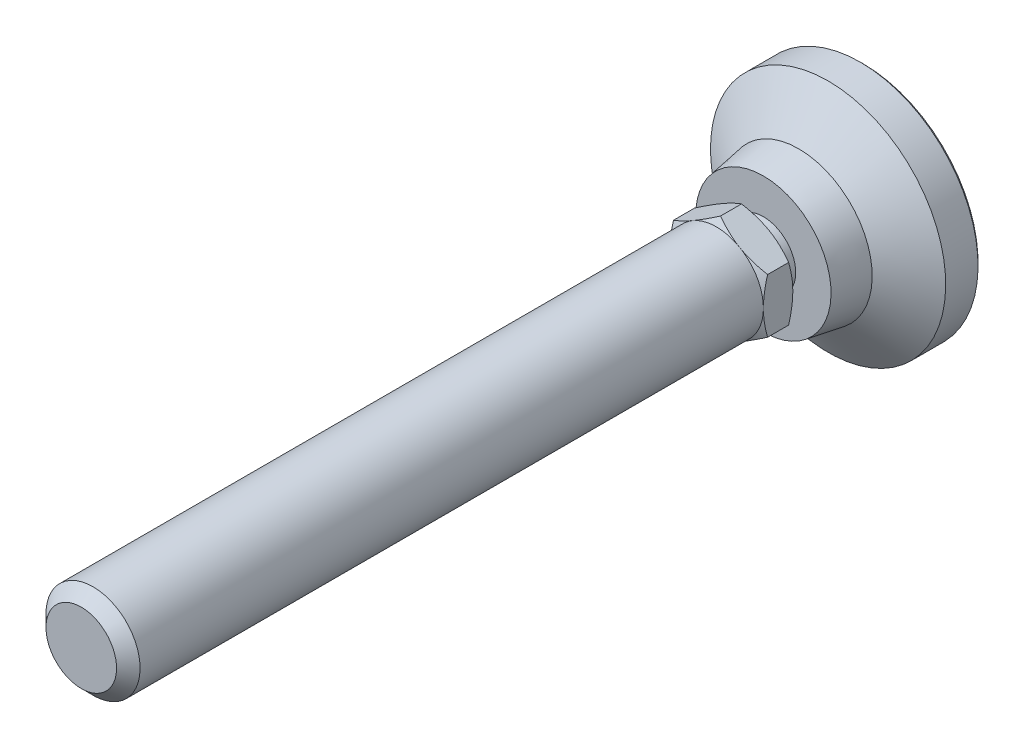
ISO-10303-21;
HEADER;
FILE_DESCRIPTION(('STEP AP214'),'2;1');
FILE_NAME('part.step','',(''),(''),'','','');
FILE_SCHEMA(('AUTOMOTIVE_DESIGN { 1 0 10303 214 1 1 1 1 }'));
ENDSEC;
DATA;
#1=APPLICATION_CONTEXT('core data for automotive mechanical design processes');
#2=APPLICATION_PROTOCOL_DEFINITION('international standard','automotive_design',2000,#1);
#3=PRODUCT_CONTEXT('',#1,'mechanical');
#4=PRODUCT('Part','Part','',(#3));
#5=PRODUCT_RELATED_PRODUCT_CATEGORY('part','',(#4));
#6=PRODUCT_DEFINITION_FORMATION('','',#4);
#7=PRODUCT_DEFINITION_CONTEXT('part definition',#1,'design');
#8=PRODUCT_DEFINITION('design','',#6,#7);
#9=PRODUCT_DEFINITION_SHAPE('','',#8);
#10=(LENGTH_UNIT() NAMED_UNIT(*) SI_UNIT(.MILLI.,.METRE.));
#11=(NAMED_UNIT(*) PLANE_ANGLE_UNIT() SI_UNIT($,.RADIAN.));
#12=(NAMED_UNIT(*) SI_UNIT($,.STERADIAN.) SOLID_ANGLE_UNIT());
#13=UNCERTAINTY_MEASURE_WITH_UNIT(LENGTH_MEASURE(1.E-05),#10,'distance_accuracy_value','');
#14=(GEOMETRIC_REPRESENTATION_CONTEXT(3) GLOBAL_UNCERTAINTY_ASSIGNED_CONTEXT((#13)) GLOBAL_UNIT_ASSIGNED_CONTEXT((#10,
#11,#12)) REPRESENTATION_CONTEXT('',''));
#15=CARTESIAN_POINT('',(0.,0.,0.));
#16=DIRECTION('',(0.,0.,1.));
#17=DIRECTION('',(1.,0.,0.));
#18=AXIS2_PLACEMENT_3D('',#15,#16,#17);
#19=CARTESIAN_POINT('',(0.,-5.50000000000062,19.9999999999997));
#20=DIRECTION('',(0.,0.,-1.));
#21=DIRECTION('',(0.,1.,0.));
#22=AXIS2_PLACEMENT_3D('',#19,#20,#21);
#23=PLANE('',#22);
#24=CARTESIAN_POINT('',(0.,0.,19.9999999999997));
#25=DIRECTION('',(0.,0.,-1.));
#26=DIRECTION('',(0.,1.,0.));
#27=AXIS2_PLACEMENT_3D('',#24,#25,#26);
#28=CIRCLE('',#27,5.50000000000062);
#29=CARTESIAN_POINT('',(0.,5.50000000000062,19.9999999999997));
#30=VERTEX_POINT('',#29);
#31=EDGE_CURVE('E289',#30,#30,#28,.T.);
#32=ORIENTED_EDGE('',*,*,#31,.F.);
#33=EDGE_LOOP('',(#32));
#34=FACE_BOUND('',#33,.T.);
#35=CARTESIAN_POINT('',(0.,0.,19.9999999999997));
#36=DIRECTION('',(0.,0.,-1.));
#37=DIRECTION('',(0.,1.,0.));
#38=AXIS2_PLACEMENT_3D('',#35,#36,#37);
#39=CIRCLE('',#38,8.00000000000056);
#40=CARTESIAN_POINT('',(-4.00000000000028,6.92820323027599,19.9999999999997));
#41=VERTEX_POINT('',#40);
#42=CARTESIAN_POINT('',(4.00000000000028,6.92820323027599,19.9999999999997));
#43=VERTEX_POINT('',#42);
#44=EDGE_CURVE('E18',#41,#43,#39,.T.);
#45=ORIENTED_EDGE('',*,*,#44,.T.);
#46=CARTESIAN_POINT('',(0.,0.,19.9999999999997));
#47=DIRECTION('',(0.,0.,-1.));
#48=DIRECTION('',(0.,1.,0.));
#49=AXIS2_PLACEMENT_3D('',#46,#47,#48);
#50=CIRCLE('',#49,8.00000000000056);
#51=CARTESIAN_POINT('',(8.00000000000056,0.,19.9999999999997));
#52=VERTEX_POINT('',#51);
#53=EDGE_CURVE('E30',#43,#52,#50,.T.);
#54=ORIENTED_EDGE('',*,*,#53,.T.);
#55=CARTESIAN_POINT('',(4.00000000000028,-6.92820323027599,19.9999999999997));
#56=VERTEX_POINT('',#55);
#57=EDGE_CURVE('E9',#52,#56,#39,.T.);
#58=ORIENTED_EDGE('',*,*,#57,.T.);
#59=CARTESIAN_POINT('',(-4.00000000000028,-6.92820323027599,19.9999999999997));
#60=VERTEX_POINT('',#59);
#61=EDGE_CURVE('E23',#56,#60,#39,.T.);
#62=ORIENTED_EDGE('',*,*,#61,.T.);
#63=CARTESIAN_POINT('',(-8.00000000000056,0.,19.9999999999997));
#64=VERTEX_POINT('',#63);
#65=EDGE_CURVE('E270',#60,#64,#39,.T.);
#66=ORIENTED_EDGE('',*,*,#65,.T.);
#67=EDGE_CURVE('E271',#64,#41,#39,.T.);
#68=ORIENTED_EDGE('',*,*,#67,.T.);
#69=EDGE_LOOP('',(#45,#54,#58,#62,#66,#68));
#70=FACE_BOUND('',#69,.T.);
#71=ADVANCED_FACE('F14',(#34,#70),#23,.T.);
#72=CARTESIAN_POINT('',(0.,0.,-1.));
#73=DIRECTION('',(0.,0.,-1.));
#74=DIRECTION('',(0.,1.,0.));
#75=AXIS2_PLACEMENT_3D('',#72,#73,#74);
#76=CYLINDRICAL_SURFACE('',#75,20.);
#77=CARTESIAN_POINT('',(0.,0.,0.500000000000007));
#78=DIRECTION('',(0.,0.,-1.));
#79=DIRECTION('',(0.,1.,0.));
#80=AXIS2_PLACEMENT_3D('',#77,#78,#79);
#81=CIRCLE('',#80,20.);
#82=CARTESIAN_POINT('',(0.,20.,0.500000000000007));
#83=VERTEX_POINT('',#82);
#84=EDGE_CURVE('E309',#83,#83,#81,.F.);
#85=ORIENTED_EDGE('',*,*,#84,.T.);
#86=EDGE_LOOP('',(#85));
#87=FACE_BOUND('',#86,.T.);
#88=CARTESIAN_POINT('',(0.,0.,6.));
#89=DIRECTION('',(0.,0.,-1.));
#90=DIRECTION('',(0.,1.,0.));
#91=AXIS2_PLACEMENT_3D('',#88,#89,#90);
#92=CIRCLE('',#91,20.);
#93=CARTESIAN_POINT('',(0.,20.,6.));
#94=VERTEX_POINT('',#93);
#95=EDGE_CURVE('E290',#94,#94,#92,.T.);
#96=ORIENTED_EDGE('',*,*,#95,.T.);
#97=EDGE_LOOP('',(#96));
#98=FACE_BOUND('',#97,.T.);
#99=ADVANCED_FACE('F332',(#87,#98),#76,.T.);
#100=CARTESIAN_POINT('',(0.,0.,-1.));
#101=DIRECTION('',(0.,0.,-1.));
#102=DIRECTION('',(0.,1.,0.));
#103=AXIS2_PLACEMENT_3D('',#100,#101,#102);
#104=CYLINDRICAL_SURFACE('',#103,5.50000000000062);
#105=CARTESIAN_POINT('',(0.,0.,17.));
#106=DIRECTION('',(0.,0.,-1.));
#107=DIRECTION('',(0.,1.,0.));
#108=AXIS2_PLACEMENT_3D('',#105,#106,#107);
#109=CIRCLE('',#108,5.50000000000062);
#110=CARTESIAN_POINT('',(0.,5.50000000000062,17.));
#111=VERTEX_POINT('',#110);
#112=EDGE_CURVE('E300',#111,#111,#109,.T.);
#113=ORIENTED_EDGE('',*,*,#112,.F.);
#114=EDGE_LOOP('',(#113));
#115=FACE_BOUND('',#114,.T.);
#116=ORIENTED_EDGE('',*,*,#31,.T.);
#117=EDGE_LOOP('',(#116));
#118=FACE_BOUND('',#117,.T.);
#119=ADVANCED_FACE('F338',(#115,#118),#104,.T.);
#120=CARTESIAN_POINT('',(-11.5,0.,17.));
#121=DIRECTION('',(0.,0.,-1.));
#122=DIRECTION('',(0.,1.,0.));
#123=AXIS2_PLACEMENT_3D('',#120,#121,#122);
#124=PLANE('',#123);
#125=CARTESIAN_POINT('',(0.,0.,17.));
#126=DIRECTION('',(0.,0.,-1.));
#127=DIRECTION('',(0.,1.,0.));
#128=AXIS2_PLACEMENT_3D('',#125,#126,#127);
#129=CIRCLE('',#128,11.5);
#130=CARTESIAN_POINT('',(0.,11.5,17.));
#131=VERTEX_POINT('',#130);
#132=EDGE_CURVE('E297',#131,#131,#129,.T.);
#133=ORIENTED_EDGE('',*,*,#132,.F.);
#134=EDGE_LOOP('',(#133));
#135=FACE_BOUND('',#134,.T.);
#136=ORIENTED_EDGE('',*,*,#112,.T.);
#137=EDGE_LOOP('',(#136));
#138=FACE_BOUND('',#137,.T.);
#139=ADVANCED_FACE('F535',(#135,#138),#124,.F.);
#140=CARTESIAN_POINT('',(0.,0.,17.));
#141=DIRECTION('',(0.,0.,-1.));
#142=DIRECTION('',(0.,1.,0.));
#143=AXIS2_PLACEMENT_3D('',#140,#141,#142);
#144=CONICAL_SURFACE('',#143,11.5,0.165148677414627);
#145=CARTESIAN_POINT('',(0.,0.,11.));
#146=DIRECTION('',(0.,0.,-1.));
#147=DIRECTION('',(0.,1.,0.));
#148=AXIS2_PLACEMENT_3D('',#145,#146,#147);
#149=CIRCLE('',#148,12.5);
#150=CARTESIAN_POINT('',(0.,12.5,11.));
#151=VERTEX_POINT('',#150);
#152=EDGE_CURVE('E293',#151,#151,#149,.T.);
#153=ORIENTED_EDGE('',*,*,#152,.F.);
#154=EDGE_LOOP('',(#153));
#155=FACE_BOUND('',#154,.T.);
#156=ORIENTED_EDGE('',*,*,#132,.T.);
#157=EDGE_LOOP('',(#156));
#158=FACE_BOUND('',#157,.T.);
#159=ADVANCED_FACE('F526',(#155,#158),#144,.T.);
#160=CARTESIAN_POINT('',(0.,0.,11.));
#161=DIRECTION('',(0.,0.,-1.));
#162=DIRECTION('',(0.,1.,0.));
#163=AXIS2_PLACEMENT_3D('',#160,#161,#162);
#164=CONICAL_SURFACE('',#163,12.5,0.982793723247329);
#165=ORIENTED_EDGE('',*,*,#95,.F.);
#166=EDGE_LOOP('',(#165));
#167=FACE_BOUND('',#166,.T.);
#168=ORIENTED_EDGE('',*,*,#152,.T.);
#169=EDGE_LOOP('',(#168));
#170=FACE_BOUND('',#169,.T.);
#171=ADVANCED_FACE('F519',(#167,#170),#164,.T.);
#172=CARTESIAN_POINT('',(0.,0.,0.));
#173=DIRECTION('',(0.,0.,-1.));
#174=DIRECTION('',(0.,1.,0.));
#175=AXIS2_PLACEMENT_3D('',#172,#173,#174);
#176=PLANE('',#175);
#177=CARTESIAN_POINT('',(0.,0.,0.));
#178=DIRECTION('',(0.,0.,-1.));
#179=DIRECTION('',(0.,1.,0.));
#180=AXIS2_PLACEMENT_3D('',#177,#178,#179);
#181=CIRCLE('',#180,19.5);
#182=CARTESIAN_POINT('',(0.,19.5,0.));
#183=VERTEX_POINT('',#182);
#184=EDGE_CURVE('E307',#183,#183,#181,.T.);
#185=ORIENTED_EDGE('',*,*,#184,.T.);
#186=EDGE_LOOP('',(#185));
#187=FACE_BOUND('',#186,.T.);
#188=ADVANCED_FACE('F235',(#187),#176,.T.);
#189=CARTESIAN_POINT('',(0.,0.,0.));
#190=DIRECTION('',(0.,0.,1.));
#191=DIRECTION('',(0.,-1.,0.));
#192=AXIS2_PLACEMENT_3D('',#189,#190,#191);
#193=CONICAL_SURFACE('',#192,19.5,0.785398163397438);
#194=ORIENTED_EDGE('',*,*,#84,.F.);
#195=EDGE_LOOP('',(#194));
#196=FACE_BOUND('',#195,.T.);
#197=ORIENTED_EDGE('',*,*,#184,.F.);
#198=EDGE_LOOP('',(#197));
#199=FACE_BOUND('',#198,.T.);
#200=ADVANCED_FACE('F16',(#196,#199),#193,.T.);
#201=CARTESIAN_POINT('',(0.,0.,19.9999999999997));
#202=DIRECTION('',(0.,0.,1.));
#203=DIRECTION('',(0.,-1.,0.));
#204=AXIS2_PLACEMENT_3D('',#201,#202,#203);
#205=CONICAL_SURFACE('',#204,8.00000000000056,1.0471975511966);
#206=ORIENTED_EDGE('',*,*,#44,.F.);
#207=CARTESIAN_POINT('',(0.000200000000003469,9.23771977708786,20.7145978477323));
#208=CARTESIAN_POINT('',(-0.175648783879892,9.13619343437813,20.6559907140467));
#209=CARTESIAN_POINT('',(-0.35215319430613,9.03428856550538,20.6000434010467));
#210=CARTESIAN_POINT('',(-0.706595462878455,8.82965122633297,20.494201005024));
#211=CARTESIAN_POINT('',(-0.884533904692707,8.72691841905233,20.4443085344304));
#212=CARTESIAN_POINT('',(-1.42119823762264,8.41707512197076,20.3046927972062));
#213=CARTESIAN_POINT('',(-1.78204258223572,8.20874154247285,20.2252811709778));
#214=CARTESIAN_POINT('',(-2.32203917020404,7.89697436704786,20.1321616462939));
#215=CARTESIAN_POINT('',(-2.49957818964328,7.79447216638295,20.1056345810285));
#216=CARTESIAN_POINT('',(-2.85545911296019,7.58900421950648,20.0611531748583));
#217=CARTESIAN_POINT('',(-3.03380094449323,7.48603851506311,20.043198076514));
#218=CARTESIAN_POINT('',(-3.39079168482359,7.27992981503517,20.0163156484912));
#219=CARTESIAN_POINT('',(-3.5694400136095,7.17678715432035,20.0073780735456));
#220=CARTESIAN_POINT('',(-3.92690170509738,6.97040655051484,19.9987223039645));
#221=CARTESIAN_POINT('',(-4.10571506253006,6.86716861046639,19.9990038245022));
#222=CARTESIAN_POINT('',(-4.4400133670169,6.67416139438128,20.0081450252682));
#223=CARTESIAN_POINT('',(-4.59552190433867,6.58437849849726,20.0158896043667));
#224=CARTESIAN_POINT('',(-4.90617476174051,6.40502298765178,20.0382011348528));
#225=CARTESIAN_POINT('',(-5.06131905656,6.31545038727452,20.0527685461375));
#226=CARTESIAN_POINT('',(-5.52615131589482,6.04707935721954,20.1063606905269));
#227=CARTESIAN_POINT('',(-5.83501648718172,5.86875596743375,20.1552686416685));
#228=CARTESIAN_POINT('',(-6.4560232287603,5.51021755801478,20.2775394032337));
#229=CARTESIAN_POINT('',(-6.76808554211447,5.33004829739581,20.3514205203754));
#230=CARTESIAN_POINT('',(-7.38755648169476,4.97239658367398,20.5191001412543));
#231=CARTESIAN_POINT('',(-7.69497304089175,4.79490955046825,20.6128592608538));
#232=CARTESIAN_POINT('',(-8.0002,4.61868668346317,20.7145978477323));
#233=B_SPLINE_CURVE_WITH_KNOTS('',3,(#207,#208,#209,#210,#211,#212,#213,#214,#215,#216,#217,
#218,#219,#220,#221,#222,#223,#224,#225,#226,#227,#228,#229,#230,#231,#232),.UNSPECIFIED.,.F.,
.F.,(4,2,2,2,2,2,2,2,2,2,2,2,4),(0.,0.633973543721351,1.26821965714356,2.53934712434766,
3.15934343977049,3.77928496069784,4.39852133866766,5.01773858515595,5.55680239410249,
6.09590254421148,7.17487077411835,8.27776850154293,9.37850115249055),.UNSPECIFIED.);
#234=CARTESIAN_POINT('',(0.,9.23760430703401,20.7145311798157));
#235=VERTEX_POINT('',#234);
#236=EDGE_CURVE('E245',#235,#41,#233,.T.);
#237=ORIENTED_EDGE('',*,*,#236,.F.);
#238=CARTESIAN_POINT('',(8.0002,4.61868668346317,20.7145978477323));
#239=CARTESIAN_POINT('',(7.8243512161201,4.7202130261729,20.6559907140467));
#240=CARTESIAN_POINT('',(7.64784680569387,4.82211789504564,20.6000434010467));
#241=CARTESIAN_POINT('',(7.29340453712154,5.02675523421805,20.494201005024));
#242=CARTESIAN_POINT('',(7.11546609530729,5.1294880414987,20.4443085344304));
#243=CARTESIAN_POINT('',(6.57880176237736,5.43933133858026,20.3046927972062));
#244=CARTESIAN_POINT('',(6.21795741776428,5.64766491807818,20.2252811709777));
#245=CARTESIAN_POINT('',(5.67796082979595,5.95943209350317,20.1321616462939));
#246=CARTESIAN_POINT('',(5.50042181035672,6.06193429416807,20.1056345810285));
#247=CARTESIAN_POINT('',(5.1445408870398,6.26740224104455,20.0611531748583));
#248=CARTESIAN_POINT('',(4.96619905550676,6.37036794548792,20.043198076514));
#249=CARTESIAN_POINT('',(4.60920831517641,6.57647664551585,20.0163156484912));
#250=CARTESIAN_POINT('',(4.4305599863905,6.67961930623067,20.0073780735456));
#251=CARTESIAN_POINT('',(4.07309829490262,6.88599991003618,19.9987223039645));
#252=CARTESIAN_POINT('',(3.89428493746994,6.98923785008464,19.9990038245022));
#253=CARTESIAN_POINT('',(3.5599866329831,7.18224506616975,20.0081450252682));
#254=CARTESIAN_POINT('',(3.40447809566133,7.27202796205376,20.0158896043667));
#255=CARTESIAN_POINT('',(3.09382523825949,7.45138347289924,20.0382011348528));
#256=CARTESIAN_POINT('',(2.93868094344,7.54095607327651,20.0527685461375));
#257=CARTESIAN_POINT('',(2.47384868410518,7.80932710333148,20.1063606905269));
#258=CARTESIAN_POINT('',(2.16498351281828,7.98765049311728,20.1552686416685));
#259=CARTESIAN_POINT('',(1.5439767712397,8.34618890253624,20.2775394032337));
#260=CARTESIAN_POINT('',(1.23191445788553,8.52635816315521,20.3514205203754));
#261=CARTESIAN_POINT('',(0.612443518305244,8.88400987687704,20.5191001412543));
#262=CARTESIAN_POINT('',(0.305026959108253,9.06149691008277,20.6128592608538));
#263=CARTESIAN_POINT('',(-0.000199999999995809,9.23771977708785,20.7145978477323));
#264=B_SPLINE_CURVE_WITH_KNOTS('',3,(#238,#239,#240,#241,#242,#243,#244,#245,#246,#247,#248,
#249,#250,#251,#252,#253,#254,#255,#256,#257,#258,#259,#260,#261,#262,#263),.UNSPECIFIED.,.F.,
.F.,(4,2,2,2,2,2,2,2,2,2,2,2,4),(0.,0.63397354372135,1.26821965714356,2.53934712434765,
3.15934343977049,3.77928496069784,4.39852133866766,5.01773858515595,5.55680239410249,
6.09590254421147,7.17487077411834,8.27776850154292,9.37850115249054),.UNSPECIFIED.);
#265=EDGE_CURVE('E244',#43,#235,#264,.T.);
#266=ORIENTED_EDGE('',*,*,#265,.F.);
#267=EDGE_LOOP('',(#206,#237,#266));
#268=FACE_BOUND('',#267,.T.);
#269=ADVANCED_FACE('F321',(#268),#205,.T.);
#270=CARTESIAN_POINT('',(-8.,4.61880215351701,20.7145311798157));
#271=VERTEX_POINT('',#270);
#272=EDGE_CURVE('E126',#41,#271,#233,.T.);
#273=ORIENTED_EDGE('',*,*,#272,.F.);
#274=ORIENTED_EDGE('',*,*,#67,.F.);
#275=CARTESIAN_POINT('',(-8.,12.3421453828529,23.872930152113));
#276=CARTESIAN_POINT('',(-8.,11.9932734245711,23.7039564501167));
#277=CARTESIAN_POINT('',(-8.,11.6435936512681,23.5366217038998));
#278=CARTESIAN_POINT('',(-8.,10.9421886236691,23.2061532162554));
#279=CARTESIAN_POINT('',(-8.,10.5904630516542,23.0430201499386));
#280=CARTESIAN_POINT('',(-8.,9.88269316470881,22.721043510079));
#281=CARTESIAN_POINT('',(-8.,9.52663571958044,22.5622286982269));
#282=CARTESIAN_POINT('',(-8.,8.81166629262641,22.251184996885));
#283=CARTESIAN_POINT('',(-8.,8.45275444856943,22.0989557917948));
#284=CARTESIAN_POINT('',(-8.,7.72016192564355,21.7981668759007));
#285=CARTESIAN_POINT('',(-8.,7.3463715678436,21.6498728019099));
#286=CARTESIAN_POINT('',(-8.,6.59439485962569,21.3646651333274));
#287=CARTESIAN_POINT('',(-8.,6.21620801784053,21.2277528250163));
#288=CARTESIAN_POINT('',(-8.,5.45556111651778,20.9689508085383));
#289=CARTESIAN_POINT('',(-8.,5.0731117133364,20.8470301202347));
#290=CARTESIAN_POINT('',(-8.,4.3027414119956,20.6221643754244));
#291=CARTESIAN_POINT('',(-8.,3.91482229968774,20.5192132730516));
#292=CARTESIAN_POINT('',(-8.,3.1353733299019,20.337822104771));
#293=CARTESIAN_POINT('',(-8.,2.74387476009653,20.2592512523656));
#294=CARTESIAN_POINT('',(-8.,2.15311394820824,20.1631126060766));
#295=CARTESIAN_POINT('',(-8.,1.95559314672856,20.1346846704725));
#296=CARTESIAN_POINT('',(-8.,1.55959187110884,20.0856270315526));
#297=CARTESIAN_POINT('',(-8.,1.36111149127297,20.0649965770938));
#298=CARTESIAN_POINT('',(-8.,0.966020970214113,20.032200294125));
#299=CARTESIAN_POINT('',(-8.,0.769419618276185,20.0199289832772));
#300=CARTESIAN_POINT('',(-8.,0.375874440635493,20.0037067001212));
#301=CARTESIAN_POINT('',(-8.,0.178930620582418,19.9997555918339));
#302=CARTESIAN_POINT('',(-8.,-0.214948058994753,20.0002678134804));
#303=CARTESIAN_POINT('',(-8.,-0.411882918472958,20.0047311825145));
#304=CARTESIAN_POINT('',(-8.,-0.805391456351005,20.0219643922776));
#305=CARTESIAN_POINT('',(-8.,-1.00196511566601,20.034734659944));
#306=CARTESIAN_POINT('',(-8.,-1.47637711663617,20.0753106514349));
#307=CARTESIAN_POINT('',(-8.,-1.75387603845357,20.1071679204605));
#308=CARTESIAN_POINT('',(-8.,-2.3067584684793,20.185683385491));
#309=CARTESIAN_POINT('',(-8.,-2.58214167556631,20.2323436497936));
#310=CARTESIAN_POINT('',(-8.,-3.4048350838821,20.3920499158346));
#311=CARTESIAN_POINT('',(-8.,-3.94836952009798,20.5247904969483));
#312=CARTESIAN_POINT('',(-8.,-4.76099062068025,20.7542648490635));
#313=CARTESIAN_POINT('',(-8.,-5.03431040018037,20.8368643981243));
#314=CARTESIAN_POINT('',(-8.,-5.57829425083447,21.0104666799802));
#315=CARTESIAN_POINT('',(-8.,-5.84895830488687,21.1014694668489));
#316=CARTESIAN_POINT('',(-8.,-6.38771904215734,21.2904328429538));
#317=CARTESIAN_POINT('',(-8.,-6.65581657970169,21.3883910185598));
#318=CARTESIAN_POINT('',(-8.,-7.18980256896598,21.590130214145));
#319=CARTESIAN_POINT('',(-8.,-7.45569104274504,21.6939111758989));
#320=CARTESIAN_POINT('',(-8.,-8.06696570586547,21.9389857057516));
#321=CARTESIAN_POINT('',(-8.,-8.41165963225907,22.0820023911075));
#322=CARTESIAN_POINT('',(-8.,-9.09824315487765,22.3746341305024));
#323=CARTESIAN_POINT('',(-8.,-9.44013260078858,22.524249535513));
#324=CARTESIAN_POINT('',(-8.,-10.1216015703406,22.8287989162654));
#325=CARTESIAN_POINT('',(-8.,-10.4611806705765,22.983733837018));
#326=CARTESIAN_POINT('',(-8.,-11.138351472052,23.2978949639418));
#327=CARTESIAN_POINT('',(-8.,-11.475943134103,23.4571212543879));
#328=CARTESIAN_POINT('',(-8.,-12.1497762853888,23.7792399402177));
#329=CARTESIAN_POINT('',(-8.,-12.4860161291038,23.9421357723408));
#330=CARTESIAN_POINT('',(-8.,-13.1570717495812,24.270837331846));
#331=CARTESIAN_POINT('',(-8.,-13.4918875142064,24.4366430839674));
#332=CARTESIAN_POINT('',(-8.,-14.4944487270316,24.9376349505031));
#333=CARTESIAN_POINT('',(-8.,-15.1603884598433,25.2764343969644));
#334=CARTESIAN_POINT('',(-8.,-16.4356681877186,25.9335377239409));
#335=CARTESIAN_POINT('',(-8.,-17.0452798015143,26.2513167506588));
#336=CARTESIAN_POINT('',(-8.,-18.2622134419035,26.8912716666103));
#337=CARTESIAN_POINT('',(-8.,-18.8695353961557,27.2134476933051));
#338=CARTESIAN_POINT('',(-8.,-20.0809800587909,27.8604175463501));
#339=CARTESIAN_POINT('',(-8.,-20.6851069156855,28.1852036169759));
#340=CARTESIAN_POINT('',(-8.,-21.8918864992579,28.8374305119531));
#341=CARTESIAN_POINT('',(-8.,-22.4945392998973,29.1648711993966));
#342=CARTESIAN_POINT('',(-8.,-23.0966447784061,29.4933084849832));
#343=B_SPLINE_CURVE_WITH_KNOTS('',3,(#275,#276,#277,#278,#279,#280,#281,#282,#283,#284,#285,
#286,#287,#288,#289,#290,#291,#292,#293,#294,#295,#296,#297,#298,#299,#300,#301,#302,#303,#304,
#305,#306,#307,#308,#309,#310,#311,#312,#313,#314,#315,#316,#317,#318,#319,#320,#321,#322,#323,
#324,#325,#326,#327,#328,#329,#330,#331,#332,#333,#334,#335,#336,#337,#338,#339,#340,#341,#342),
.UNSPECIFIED.,.F.,.F.,(4,2,2,2,2,2,2,2,2,2,2,2,2,2,2,2,2,2,2,2,2,2,2,2,2,2,2,2,2,2,2,2,2,4),(0.,
1.16293058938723,2.32604688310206,3.49560514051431,4.66510728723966,5.87136032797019,
7.07774950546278,8.28160222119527,9.48507058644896,10.6819667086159,11.2805051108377,
11.8789858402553,12.4697671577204,13.0605388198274,13.6513132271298,14.2421179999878,
15.0796080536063,15.9172151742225,17.5933882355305,18.4499038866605,19.3064250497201,
20.162650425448,21.0188672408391,22.1383339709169,23.2578603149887,24.3775865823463,
25.4973348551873,26.618179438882,27.7390335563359,29.9804741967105,32.0428536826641,
34.1052977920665,36.1629829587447,38.2205626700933),.UNSPECIFIED.);
#344=EDGE_CURVE('E38',#271,#64,#343,.T.);
#345=ORIENTED_EDGE('',*,*,#344,.F.);
#346=EDGE_LOOP('',(#273,#274,#345));
#347=FACE_BOUND('',#346,.T.);
#348=ADVANCED_FACE('F155',(#347),#205,.T.);
#349=CARTESIAN_POINT('',(-8.,-4.618802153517,20.7145311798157));
#350=VERTEX_POINT('',#349);
#351=EDGE_CURVE('E246',#64,#350,#343,.T.);
#352=ORIENTED_EDGE('',*,*,#351,.F.);
#353=ORIENTED_EDGE('',*,*,#65,.F.);
#354=CARTESIAN_POINT('',(-8.0002,-4.61868668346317,20.7145978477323));
#355=CARTESIAN_POINT('',(-7.8243512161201,-4.7202130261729,20.6559907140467));
#356=CARTESIAN_POINT('',(-7.64784680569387,-4.82211789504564,20.6000434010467));
#357=CARTESIAN_POINT('',(-7.29340453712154,-5.02675523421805,20.494201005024));
#358=CARTESIAN_POINT('',(-7.11546609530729,-5.12948804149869,20.4443085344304));
#359=CARTESIAN_POINT('',(-6.57880176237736,-5.43933133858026,20.3046927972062));
#360=CARTESIAN_POINT('',(-6.21795741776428,-5.64766491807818,20.2252811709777));
#361=CARTESIAN_POINT('',(-5.67796082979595,-5.95943209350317,20.1321616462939));
#362=CARTESIAN_POINT('',(-5.50042181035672,-6.06193429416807,20.1056345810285));
#363=CARTESIAN_POINT('',(-5.1445408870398,-6.26740224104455,20.0611531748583));
#364=CARTESIAN_POINT('',(-4.96619905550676,-6.37036794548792,20.043198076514));
#365=CARTESIAN_POINT('',(-4.60920831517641,-6.57647664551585,20.0163156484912));
#366=CARTESIAN_POINT('',(-4.4305599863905,-6.67961930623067,20.0073780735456));
#367=CARTESIAN_POINT('',(-4.07309829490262,-6.88599991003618,19.9987223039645));
#368=CARTESIAN_POINT('',(-3.89428493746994,-6.98923785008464,19.9990038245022));
#369=CARTESIAN_POINT('',(-3.5599866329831,-7.18224506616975,20.0081450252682));
#370=CARTESIAN_POINT('',(-3.40447809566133,-7.27202796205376,20.0158896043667));
#371=CARTESIAN_POINT('',(-3.09382523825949,-7.45138347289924,20.0382011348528));
#372=CARTESIAN_POINT('',(-2.93868094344,-7.5409560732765,20.0527685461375));
#373=CARTESIAN_POINT('',(-2.47384868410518,-7.80932710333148,20.1063606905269));
#374=CARTESIAN_POINT('',(-2.16498351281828,-7.98765049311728,20.1552686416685));
#375=CARTESIAN_POINT('',(-1.5439767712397,-8.34618890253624,20.2775394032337));
#376=CARTESIAN_POINT('',(-1.23191445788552,-8.52635816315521,20.3514205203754));
#377=CARTESIAN_POINT('',(-0.612443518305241,-8.88400987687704,20.5191001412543));
#378=CARTESIAN_POINT('',(-0.30502695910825,-9.06149691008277,20.6128592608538));
#379=CARTESIAN_POINT('',(0.000199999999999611,-9.23771977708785,20.7145978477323));
#380=B_SPLINE_CURVE_WITH_KNOTS('',3,(#354,#355,#356,#357,#358,#359,#360,#361,#362,#363,#364,
#365,#366,#367,#368,#369,#370,#371,#372,#373,#374,#375,#376,#377,#378,#379),.UNSPECIFIED.,.F.,
.F.,(4,2,2,2,2,2,2,2,2,2,2,2,4),(0.,0.63397354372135,1.26821965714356,2.53934712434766,
3.15934343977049,3.77928496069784,4.39852133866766,5.01773858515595,5.55680239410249,
6.09590254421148,7.17487077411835,8.27776850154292,9.37850115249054),.UNSPECIFIED.);
#381=EDGE_CURVE('E113',#350,#60,#380,.T.);
#382=ORIENTED_EDGE('',*,*,#381,.F.);
#383=EDGE_LOOP('',(#352,#353,#382));
#384=FACE_BOUND('',#383,.T.);
#385=ADVANCED_FACE('F268',(#384),#205,.T.);
#386=CARTESIAN_POINT('',(0.,-9.23760430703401,20.7145311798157));
#387=VERTEX_POINT('',#386);
#388=EDGE_CURVE('E133',#60,#387,#380,.T.);
#389=ORIENTED_EDGE('',*,*,#388,.F.);
#390=ORIENTED_EDGE('',*,*,#61,.F.);
#391=CARTESIAN_POINT('',(-0.0002,-9.23771977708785,20.7145978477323));
#392=CARTESIAN_POINT('',(0.175648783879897,-9.13619343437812,20.6559907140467));
#393=CARTESIAN_POINT('',(0.352153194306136,-9.03428856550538,20.6000434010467));
#394=CARTESIAN_POINT('',(0.706595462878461,-8.82965122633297,20.494201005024));
#395=CARTESIAN_POINT('',(0.884533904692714,-8.72691841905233,20.4443085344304));
#396=CARTESIAN_POINT('',(1.42119823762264,-8.41707512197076,20.3046927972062));
#397=CARTESIAN_POINT('',(1.78204258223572,-8.20874154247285,20.2252811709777));
#398=CARTESIAN_POINT('',(2.32203917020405,-7.89697436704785,20.1321616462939));
#399=CARTESIAN_POINT('',(2.49957818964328,-7.79447216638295,20.1056345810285));
#400=CARTESIAN_POINT('',(2.8554591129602,-7.58900421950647,20.0611531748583));
#401=CARTESIAN_POINT('',(3.03380094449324,-7.4860385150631,20.043198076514));
#402=CARTESIAN_POINT('',(3.39079168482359,-7.27992981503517,20.0163156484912));
#403=CARTESIAN_POINT('',(3.5694400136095,-7.17678715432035,20.0073780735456));
#404=CARTESIAN_POINT('',(3.92690170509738,-6.97040655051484,19.9987223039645));
#405=CARTESIAN_POINT('',(4.10571506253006,-6.86716861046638,19.9990038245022));
#406=CARTESIAN_POINT('',(4.4400133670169,-6.67416139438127,20.0081450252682));
#407=CARTESIAN_POINT('',(4.59552190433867,-6.58437849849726,20.0158896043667));
#408=CARTESIAN_POINT('',(4.90617476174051,-6.40502298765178,20.0382011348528));
#409=CARTESIAN_POINT('',(5.06131905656,-6.31545038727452,20.0527685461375));
#410=CARTESIAN_POINT('',(5.52615131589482,-6.04707935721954,20.1063606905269));
#411=CARTESIAN_POINT('',(5.83501648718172,-5.86875596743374,20.1552686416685));
#412=CARTESIAN_POINT('',(6.4560232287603,-5.51021755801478,20.2775394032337));
#413=CARTESIAN_POINT('',(6.76808554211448,-5.33004829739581,20.3514205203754));
#414=CARTESIAN_POINT('',(7.38755648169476,-4.97239658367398,20.5191001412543));
#415=CARTESIAN_POINT('',(7.69497304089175,-4.79490955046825,20.6128592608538));
#416=CARTESIAN_POINT('',(8.0002,-4.61868668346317,20.7145978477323));
#417=B_SPLINE_CURVE_WITH_KNOTS('',3,(#391,#392,#393,#394,#395,#396,#397,#398,#399,#400,#401,
#402,#403,#404,#405,#406,#407,#408,#409,#410,#411,#412,#413,#414,#415,#416),.UNSPECIFIED.,.F.,
.F.,(4,2,2,2,2,2,2,2,2,2,2,2,4),(0.,0.63397354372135,1.26821965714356,2.53934712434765,
3.15934343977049,3.77928496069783,4.39852133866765,5.01773858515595,5.55680239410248,
6.09590254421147,7.17487077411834,8.27776850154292,9.37850115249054),.UNSPECIFIED.);
#418=EDGE_CURVE('E274',#387,#56,#417,.T.);
#419=ORIENTED_EDGE('',*,*,#418,.F.);
#420=EDGE_LOOP('',(#389,#390,#419));
#421=FACE_BOUND('',#420,.T.);
#422=ADVANCED_FACE('F273',(#421),#205,.T.);
#423=ORIENTED_EDGE('',*,*,#57,.F.);
#424=CARTESIAN_POINT('',(8.,12.3421453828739,23.8729301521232));
#425=CARTESIAN_POINT('',(8.,11.9932734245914,23.7039564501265));
#426=CARTESIAN_POINT('',(8.,11.6435936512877,23.5366217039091));
#427=CARTESIAN_POINT('',(8.,10.9421886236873,23.2061532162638));
#428=CARTESIAN_POINT('',(8.,10.5904630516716,23.0430201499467));
#429=CARTESIAN_POINT('',(8.,9.88269316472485,22.7210435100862));
#430=CARTESIAN_POINT('',(8.,9.52663571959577,22.5622286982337));
#431=CARTESIAN_POINT('',(8.,8.81166629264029,22.251184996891));
#432=CARTESIAN_POINT('',(8.,8.4527544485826,22.0989557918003));
#433=CARTESIAN_POINT('',(8.,7.72016192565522,21.7981668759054));
#434=CARTESIAN_POINT('',(8.,7.34637156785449,21.6498728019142));
#435=CARTESIAN_POINT('',(8.,6.59439485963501,21.3646651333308));
#436=CARTESIAN_POINT('',(8.,6.21620801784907,21.2277528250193));
#437=CARTESIAN_POINT('',(8.,5.45556111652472,20.9689508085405));
#438=CARTESIAN_POINT('',(8.,5.07311171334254,20.8470301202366));
#439=CARTESIAN_POINT('',(8.,4.30274141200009,20.6221643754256));
#440=CARTESIAN_POINT('',(8.,3.9148222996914,20.5192132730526));
#441=CARTESIAN_POINT('',(8.,3.13537332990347,20.3378221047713));
#442=CARTESIAN_POINT('',(8.,2.74387476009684,20.2592512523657));
#443=CARTESIAN_POINT('',(8.,2.15311394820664,20.1631126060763));
#444=CARTESIAN_POINT('',(8.,1.95559314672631,20.1346846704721));
#445=CARTESIAN_POINT('',(8.,1.5595918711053,20.0856270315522));
#446=CARTESIAN_POINT('',(8.,1.36111149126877,20.0649965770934));
#447=CARTESIAN_POINT('',(8.,0.966020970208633,20.0322002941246));
#448=CARTESIAN_POINT('',(8.,0.769419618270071,20.0199289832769));
#449=CARTESIAN_POINT('',(8.,0.375874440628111,20.003706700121));
#450=CARTESIAN_POINT('',(8.,0.178930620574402,19.9997555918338));
#451=CARTESIAN_POINT('',(8.,-0.21494805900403,20.0002678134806));
#452=CARTESIAN_POINT('',(8.,-0.411882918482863,20.0047311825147));
#453=CARTESIAN_POINT('',(8.,-0.805391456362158,20.0219643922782));
#454=CARTESIAN_POINT('',(8.,-1.00196511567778,20.0347346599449));
#455=CARTESIAN_POINT('',(8.,-1.47637711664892,20.0753106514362));
#456=CARTESIAN_POINT('',(8.,-1.75387603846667,20.1071679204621));
#457=CARTESIAN_POINT('',(8.,-2.30675846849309,20.1856833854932));
#458=CARTESIAN_POINT('',(8.,-2.58214167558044,20.2323436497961));
#459=CARTESIAN_POINT('',(8.,-3.40483508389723,20.392049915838));
#460=CARTESIAN_POINT('',(8.,-3.94836952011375,20.5247904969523));
#461=CARTESIAN_POINT('',(8.,-4.76099062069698,20.7542648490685));
#462=CARTESIAN_POINT('',(8.,-5.03431040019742,20.8368643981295));
#463=CARTESIAN_POINT('',(8.,-5.57829425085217,21.010466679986));
#464=CARTESIAN_POINT('',(8.,-5.8489583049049,21.101469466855));
#465=CARTESIAN_POINT('',(8.,-6.38771904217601,21.2904328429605));
#466=CARTESIAN_POINT('',(8.,-6.65581657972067,21.3883910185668));
#467=CARTESIAN_POINT('',(8.,-7.18980256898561,21.5901302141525));
#468=CARTESIAN_POINT('',(8.,-7.45569104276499,21.6939111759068));
#469=CARTESIAN_POINT('',(8.,-8.06696570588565,21.9389857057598));
#470=CARTESIAN_POINT('',(8.,-8.41165963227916,22.0820023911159));
#471=CARTESIAN_POINT('',(8.,-9.09824315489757,22.374634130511));
#472=CARTESIAN_POINT('',(8.,-9.44013260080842,22.5242495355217));
#473=CARTESIAN_POINT('',(8.,-10.1216015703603,22.8287989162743));
#474=CARTESIAN_POINT('',(8.,-10.4611806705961,22.983733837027));
#475=CARTESIAN_POINT('',(8.,-11.1383514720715,23.2978949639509));
#476=CARTESIAN_POINT('',(8.,-11.4759431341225,23.4571212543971));
#477=CARTESIAN_POINT('',(8.,-12.1497762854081,23.7792399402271));
#478=CARTESIAN_POINT('',(8.,-12.486016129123,23.9421357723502));
#479=CARTESIAN_POINT('',(8.,-13.1570717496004,24.2708373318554));
#480=CARTESIAN_POINT('',(8.,-13.4918875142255,24.4366430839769));
#481=CARTESIAN_POINT('',(8.,-14.4944487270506,24.9376349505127));
#482=CARTESIAN_POINT('',(8.,-15.1603884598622,25.276434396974));
#483=CARTESIAN_POINT('',(8.,-16.4356681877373,25.9335377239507));
#484=CARTESIAN_POINT('',(8.,-17.045279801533,26.2513167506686));
#485=CARTESIAN_POINT('',(8.,-18.2622134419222,26.8912716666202));
#486=CARTESIAN_POINT('',(7.99999999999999,-18.8695353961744,27.213447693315));
#487=CARTESIAN_POINT('',(7.99999999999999,-20.0809800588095,27.8604175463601));
#488=CARTESIAN_POINT('',(7.99999999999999,-20.6851069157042,28.185203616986));
#489=CARTESIAN_POINT('',(7.99999999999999,-21.8918864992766,28.8374305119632));
#490=CARTESIAN_POINT('',(8.,-22.494539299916,29.1648711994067));
#491=CARTESIAN_POINT('',(8.,-23.0966447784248,29.4933084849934));
#492=B_SPLINE_CURVE_WITH_KNOTS('',3,(#424,#425,#426,#427,#428,#429,#430,#431,#432,#433,#434,
#435,#436,#437,#438,#439,#440,#441,#442,#443,#444,#445,#446,#447,#448,#449,#450,#451,#452,#453,
#454,#455,#456,#457,#458,#459,#460,#461,#462,#463,#464,#465,#466,#467,#468,#469,#470,#471,#472,
#473,#474,#475,#476,#477,#478,#479,#480,#481,#482,#483,#484,#485,#486,#487,#488,#489,#490,#491),
.UNSPECIFIED.,.F.,.F.,(4,2,2,2,2,2,2,2,2,2,2,2,2,2,2,2,2,2,2,2,2,2,2,2,2,2,2,2,2,2,2,2,2,4),(0.,
1.16293058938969,2.32604688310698,3.49560514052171,4.66510728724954,5.87136032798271,
7.07774950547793,8.28160222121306,9.48507058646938,10.6819667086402,11.2805051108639,
11.8789858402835,12.4697671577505,13.0605388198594,13.6513132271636,14.2421180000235,
15.0796080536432,15.9172151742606,17.5933882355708,18.449903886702,19.3064250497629,
20.162650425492,21.0188672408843,22.1383339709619,23.2578603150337,24.3775865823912,
25.4973348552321,26.6181794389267,27.7390335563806,29.980474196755,32.0428536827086,
34.105297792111,36.1629829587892,38.2205626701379),.UNSPECIFIED.);
#493=CARTESIAN_POINT('',(8.,-4.61880215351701,20.7145311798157));
#494=VERTEX_POINT('',#493);
#495=EDGE_CURVE('E112',#494,#52,#492,.F.);
#496=ORIENTED_EDGE('',*,*,#495,.F.);
#497=EDGE_CURVE('E118',#56,#494,#417,.T.);
#498=ORIENTED_EDGE('',*,*,#497,.F.);
#499=EDGE_LOOP('',(#423,#496,#498));
#500=FACE_BOUND('',#499,.T.);
#501=ADVANCED_FACE('F116',(#500),#205,.T.);
#502=ORIENTED_EDGE('',*,*,#53,.F.);
#503=CARTESIAN_POINT('',(8.,4.61880215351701,20.7145311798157));
#504=VERTEX_POINT('',#503);
#505=EDGE_CURVE('E107',#504,#43,#264,.T.);
#506=ORIENTED_EDGE('',*,*,#505,.F.);
#507=EDGE_CURVE('E103',#52,#504,#492,.F.);
#508=ORIENTED_EDGE('',*,*,#507,.F.);
#509=EDGE_LOOP('',(#502,#506,#508));
#510=FACE_BOUND('',#509,.T.);
#511=ADVANCED_FACE('F105',(#510),#205,.T.);
#512=CARTESIAN_POINT('',(0.,0.,133.));
#513=DIRECTION('',(0.,0.,-1.));
#514=DIRECTION('',(0.,1.,0.));
#515=AXIS2_PLACEMENT_3D('',#512,#513,#514);
#516=PLANE('',#515);
#517=CARTESIAN_POINT('',(0.,0.,133.));
#518=DIRECTION('',(0.,0.,-1.));
#519=DIRECTION('',(0.,1.,0.));
#520=AXIS2_PLACEMENT_3D('',#517,#518,#519);
#521=CIRCLE('',#520,6.00000000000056);
#522=CARTESIAN_POINT('',(0.,6.00000000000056,133.));
#523=VERTEX_POINT('',#522);
#524=EDGE_CURVE('E353',#523,#523,#521,.T.);
#525=ORIENTED_EDGE('',*,*,#524,.F.);
#526=EDGE_LOOP('',(#525));
#527=FACE_BOUND('',#526,.T.);
#528=ADVANCED_FACE('F341',(#527),#516,.F.);
#529=CARTESIAN_POINT('',(0.,0.,133.));
#530=DIRECTION('',(0.,0.,-1.));
#531=DIRECTION('',(0.,1.,0.));
#532=AXIS2_PLACEMENT_3D('',#529,#530,#531);
#533=CONICAL_SURFACE('',#532,6.00000000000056,0.785398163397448);
#534=CARTESIAN_POINT('',(0.,0.,131.));
#535=DIRECTION('',(0.,0.,-1.));
#536=DIRECTION('',(0.,1.,0.));
#537=AXIS2_PLACEMENT_3D('',#534,#535,#536);
#538=CIRCLE('',#537,8.00000000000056);
#539=CARTESIAN_POINT('',(0.,8.00000000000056,131.));
#540=VERTEX_POINT('',#539);
#541=EDGE_CURVE('E355',#540,#540,#538,.T.);
#542=ORIENTED_EDGE('',*,*,#541,.F.);
#543=EDGE_LOOP('',(#542));
#544=FACE_BOUND('',#543,.T.);
#545=ORIENTED_EDGE('',*,*,#524,.T.);
#546=EDGE_LOOP('',(#545));
#547=FACE_BOUND('',#546,.T.);
#548=ADVANCED_FACE('F197',(#544,#547),#533,.T.);
#549=CARTESIAN_POINT('',(0.,0.,-1.));
#550=DIRECTION('',(0.,0.,-1.));
#551=DIRECTION('',(0.,1.,0.));
#552=AXIS2_PLACEMENT_3D('',#549,#550,#551);
#553=CYLINDRICAL_SURFACE('',#552,8.00000000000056);
#554=CARTESIAN_POINT('',(0.,0.,25.));
#555=DIRECTION('',(0.,0.,-1.));
#556=DIRECTION('',(0.,1.,0.));
#557=AXIS2_PLACEMENT_3D('',#554,#555,#556);
#558=CIRCLE('',#557,8.00000000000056);
#559=CARTESIAN_POINT('',(4.,6.92820323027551,25.));
#560=VERTEX_POINT('',#559);
#561=CARTESIAN_POINT('',(8.,0.,25.));
#562=VERTEX_POINT('',#561);
#563=EDGE_CURVE('E276',#560,#562,#558,.T.);
#564=ORIENTED_EDGE('',*,*,#563,.F.);
#565=CARTESIAN_POINT('',(0.,0.,25.));
#566=DIRECTION('',(0.,0.,-1.));
#567=DIRECTION('',(0.,1.,0.));
#568=AXIS2_PLACEMENT_3D('',#565,#566,#567);
#569=CIRCLE('',#568,8.00000000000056);
#570=CARTESIAN_POINT('',(-4.,6.92820323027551,25.));
#571=VERTEX_POINT('',#570);
#572=EDGE_CURVE('E303',#571,#560,#569,.T.);
#573=ORIENTED_EDGE('',*,*,#572,.F.);
#574=CARTESIAN_POINT('',(-8.,0.,25.));
#575=VERTEX_POINT('',#574);
#576=EDGE_CURVE('E305',#575,#571,#569,.T.);
#577=ORIENTED_EDGE('',*,*,#576,.F.);
#578=CARTESIAN_POINT('',(-4.,-6.92820323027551,25.));
#579=VERTEX_POINT('',#578);
#580=EDGE_CURVE('E370',#579,#575,#569,.T.);
#581=ORIENTED_EDGE('',*,*,#580,.F.);
#582=CARTESIAN_POINT('',(4.,-6.92820323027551,25.));
#583=VERTEX_POINT('',#582);
#584=EDGE_CURVE('E601',#583,#579,#569,.T.);
#585=ORIENTED_EDGE('',*,*,#584,.F.);
#586=EDGE_CURVE('E306',#562,#583,#569,.T.);
#587=ORIENTED_EDGE('',*,*,#586,.F.);
#588=EDGE_LOOP('',(#564,#573,#577,#581,#585,#587));
#589=FACE_BOUND('',#588,.T.);
#590=ORIENTED_EDGE('',*,*,#541,.T.);
#591=EDGE_LOOP('',(#590));
#592=FACE_BOUND('',#591,.T.);
#593=ADVANCED_FACE('F349',(#589,#592),#553,.T.);
#594=CARTESIAN_POINT('',(0.,0.,23.6210154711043));
#595=DIRECTION('',(0.,0.,-1.));
#596=DIRECTION('',(0.,1.,0.));
#597=AXIS2_PLACEMENT_3D('',#594,#595,#596);
#598=CONICAL_SURFACE('',#597,10.3884712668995,1.0471975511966);
#599=ORIENTED_EDGE('',*,*,#563,.T.);
#600=CARTESIAN_POINT('',(8.,12.3421453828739,21.1270698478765));
#601=CARTESIAN_POINT('',(8.,11.9932734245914,21.2960435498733));
#602=CARTESIAN_POINT('',(8.,11.6435936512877,21.4633782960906));
#603=CARTESIAN_POINT('',(8.,10.9421886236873,21.7938467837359));
#604=CARTESIAN_POINT('',(8.,10.5904630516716,21.9569798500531));
#605=CARTESIAN_POINT('',(8.,9.88269316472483,22.2789564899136));
#606=CARTESIAN_POINT('',(8.,9.52663571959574,22.4377713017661));
#607=CARTESIAN_POINT('',(8.,8.81166629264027,22.7488150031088));
#608=CARTESIAN_POINT('',(8.,8.45275444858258,22.9010442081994));
#609=CARTESIAN_POINT('',(8.,7.7201619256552,23.2018331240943));
#610=CARTESIAN_POINT('',(8.,7.34637156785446,23.3501271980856));
#611=CARTESIAN_POINT('',(8.,6.59439485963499,23.6353348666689));
#612=CARTESIAN_POINT('',(8.,6.21620801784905,23.7722471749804));
#613=CARTESIAN_POINT('',(8.,5.45556111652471,24.0310491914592));
#614=CARTESIAN_POINT('',(8.,5.07311171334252,24.1529698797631));
#615=CARTESIAN_POINT('',(8.,4.30274141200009,24.3778356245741));
#616=CARTESIAN_POINT('',(8.,3.9148222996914,24.4807867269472));
#617=CARTESIAN_POINT('',(8.,3.13537332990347,24.6621778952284));
#618=CARTESIAN_POINT('',(8.,2.74387476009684,24.7407487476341));
#619=CARTESIAN_POINT('',(8.,2.15311394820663,24.8368873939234));
#620=CARTESIAN_POINT('',(8.,1.95559314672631,24.8653153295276));
#621=CARTESIAN_POINT('',(8.,1.5595918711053,24.9143729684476));
#622=CARTESIAN_POINT('',(8.,1.36111149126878,24.9350034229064));
#623=CARTESIAN_POINT('',(8.,0.966020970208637,24.9677997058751));
#624=CARTESIAN_POINT('',(8.,0.769419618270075,24.9800710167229));
#625=CARTESIAN_POINT('',(8.,0.375874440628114,24.9962932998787));
#626=CARTESIAN_POINT('',(8.,0.178930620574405,25.0002444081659));
#627=CARTESIAN_POINT('',(8.,-0.214948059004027,24.9997321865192));
#628=CARTESIAN_POINT('',(8.,-0.411882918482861,24.995268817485));
#629=CARTESIAN_POINT('',(8.,-0.805391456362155,24.9780356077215));
#630=CARTESIAN_POINT('',(8.,-1.00196511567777,24.9652653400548));
#631=CARTESIAN_POINT('',(8.,-1.47637711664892,24.9246893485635));
#632=CARTESIAN_POINT('',(8.,-1.75387603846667,24.8928320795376));
#633=CARTESIAN_POINT('',(8.,-2.3067584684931,24.8143166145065));
#634=CARTESIAN_POINT('',(8.,-2.58214167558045,24.7676563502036));
#635=CARTESIAN_POINT('',(8.,-3.40483508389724,24.6079500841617));
#636=CARTESIAN_POINT('',(8.,-3.94836952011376,24.4752095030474));
#637=CARTESIAN_POINT('',(8.,-4.76099062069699,24.2457351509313));
#638=CARTESIAN_POINT('',(8.,-5.03431040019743,24.1631356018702));
#639=CARTESIAN_POINT('',(8.,-5.57829425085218,23.9895333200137));
#640=CARTESIAN_POINT('',(8.,-5.8489583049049,23.8985305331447));
#641=CARTESIAN_POINT('',(8.,-6.38771904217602,23.7095671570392));
#642=CARTESIAN_POINT('',(8.,-6.65581657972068,23.6116089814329));
#643=CARTESIAN_POINT('',(8.,-7.18980256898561,23.4098697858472));
#644=CARTESIAN_POINT('',(8.,-7.45569104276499,23.3060888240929));
#645=CARTESIAN_POINT('',(8.,-8.06696570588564,23.0610142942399));
#646=CARTESIAN_POINT('',(8.,-8.41165963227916,22.9179976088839));
#647=CARTESIAN_POINT('',(8.,-9.09824315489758,22.6253658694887));
#648=CARTESIAN_POINT('',(8.,-9.44013260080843,22.475750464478));
#649=CARTESIAN_POINT('',(8.,-10.1216015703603,22.1712010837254));
#650=CARTESIAN_POINT('',(8.,-10.4611806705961,22.0162661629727));
#651=CARTESIAN_POINT('',(8.,-11.1383514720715,21.7021050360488));
#652=CARTESIAN_POINT('',(8.,-11.4759431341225,21.5428787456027));
#653=CARTESIAN_POINT('',(8.,-12.1497762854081,21.2207600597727));
#654=CARTESIAN_POINT('',(8.,-12.486016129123,21.0578642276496));
#655=CARTESIAN_POINT('',(8.,-13.1570717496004,20.7291626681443));
#656=CARTESIAN_POINT('',(8.,-13.4918875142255,20.5633569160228));
#657=CARTESIAN_POINT('',(8.,-14.4944487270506,20.062365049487));
#658=CARTESIAN_POINT('',(8.,-15.1603884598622,19.7235656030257));
#659=CARTESIAN_POINT('',(8.,-16.4356681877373,19.0664622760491));
#660=CARTESIAN_POINT('',(8.,-17.045279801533,18.7486832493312));
#661=CARTESIAN_POINT('',(8.,-18.2622134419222,18.1087283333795));
#662=CARTESIAN_POINT('',(7.99999999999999,-18.8695353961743,17.7865523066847));
#663=CARTESIAN_POINT('',(7.99999999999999,-20.0809800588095,17.1395824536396));
#664=CARTESIAN_POINT('',(7.99999999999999,-20.6851069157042,16.8147963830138));
#665=CARTESIAN_POINT('',(7.99999999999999,-21.8918864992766,16.1625694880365));
#666=CARTESIAN_POINT('',(8.,-22.494539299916,15.835128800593));
#667=CARTESIAN_POINT('',(8.,-23.0966447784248,15.5066915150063));
#668=B_SPLINE_CURVE_WITH_KNOTS('',3,(#600,#601,#602,#603,#604,#605,#606,#607,#608,#609,#610,
#611,#612,#613,#614,#615,#616,#617,#618,#619,#620,#621,#622,#623,#624,#625,#626,#627,#628,#629,
#630,#631,#632,#633,#634,#635,#636,#637,#638,#639,#640,#641,#642,#643,#644,#645,#646,#647,#648,
#649,#650,#651,#652,#653,#654,#655,#656,#657,#658,#659,#660,#661,#662,#663,#664,#665,#666,#667),
.UNSPECIFIED.,.F.,.F.,(4,2,2,2,2,2,2,2,2,2,2,2,2,2,2,2,2,2,2,2,2,2,2,2,2,2,2,2,2,2,2,2,2,4),(0.,
1.16293058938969,2.32604688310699,3.49560514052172,4.66510728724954,5.87136032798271,
7.07774950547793,8.28160222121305,9.48507058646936,10.6819667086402,11.2805051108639,
11.8789858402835,12.4697671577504,13.0605388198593,13.6513132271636,14.2421180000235,
15.0796080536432,15.9172151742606,17.5933882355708,18.449903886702,19.3064250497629,
20.162650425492,21.0188672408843,22.1383339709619,23.2578603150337,24.3775865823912,
25.4973348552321,26.6181794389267,27.7390335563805,29.9804741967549,32.0428536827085,
34.105297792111,36.1629829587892,38.2205626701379),.UNSPECIFIED.);
#669=CARTESIAN_POINT('',(8.,4.61880215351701,24.285468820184));
#670=VERTEX_POINT('',#669);
#671=EDGE_CURVE('E175',#670,#562,#668,.T.);
#672=ORIENTED_EDGE('',*,*,#671,.F.);
#673=CARTESIAN_POINT('',(-0.000199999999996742,9.23771977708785,24.2854021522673));
#674=CARTESIAN_POINT('',(0.175648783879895,9.13619343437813,24.344009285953));
#675=CARTESIAN_POINT('',(0.352153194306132,9.03428856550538,24.3999565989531));
#676=CARTESIAN_POINT('',(0.706595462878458,8.82965122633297,24.5057989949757));
#677=CARTESIAN_POINT('',(0.884533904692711,8.72691841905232,24.5556914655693));
#678=CARTESIAN_POINT('',(1.42119823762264,8.41707512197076,24.6953072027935));
#679=CARTESIAN_POINT('',(1.78204258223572,8.20874154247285,24.774718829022));
#680=CARTESIAN_POINT('',(2.32203917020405,7.89697436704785,24.8678383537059));
#681=CARTESIAN_POINT('',(2.49957818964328,7.79447216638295,24.8943654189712));
#682=CARTESIAN_POINT('',(2.8554591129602,7.58900421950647,24.9388468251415));
#683=CARTESIAN_POINT('',(3.03380094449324,7.4860385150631,24.9568019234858));
#684=CARTESIAN_POINT('',(3.39079168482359,7.27992981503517,24.9836843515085));
#685=CARTESIAN_POINT('',(3.5694400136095,7.17678715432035,24.9926219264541));
#686=CARTESIAN_POINT('',(3.92690170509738,6.97040655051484,25.0012776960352));
#687=CARTESIAN_POINT('',(4.10571506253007,6.86716861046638,25.0009961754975));
#688=CARTESIAN_POINT('',(4.44001336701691,6.67416139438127,24.9918549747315));
#689=CARTESIAN_POINT('',(4.59552190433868,6.58437849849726,24.984110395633));
#690=CARTESIAN_POINT('',(4.90617476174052,6.40502298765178,24.9617988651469));
#691=CARTESIAN_POINT('',(5.06131905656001,6.31545038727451,24.9472314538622));
#692=CARTESIAN_POINT('',(5.52615131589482,6.04707935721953,24.8936393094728));
#693=CARTESIAN_POINT('',(5.83501648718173,5.86875596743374,24.8447313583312));
#694=CARTESIAN_POINT('',(6.4560232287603,5.51021755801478,24.722460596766));
#695=CARTESIAN_POINT('',(6.76808554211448,5.3300482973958,24.6485794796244));
#696=CARTESIAN_POINT('',(7.38755648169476,4.97239658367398,24.4808998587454));
#697=CARTESIAN_POINT('',(7.69497304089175,4.79490955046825,24.3871407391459));
#698=CARTESIAN_POINT('',(8.0002,4.61868668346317,24.2854021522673));
#699=B_SPLINE_CURVE_WITH_KNOTS('',3,(#673,#674,#675,#676,#677,#678,#679,#680,#681,#682,#683,
#684,#685,#686,#687,#688,#689,#690,#691,#692,#693,#694,#695,#696,#697,#698),.UNSPECIFIED.,.F.,
.F.,(4,2,2,2,2,2,2,2,2,2,2,2,4),(0.,0.633973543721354,1.26821965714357,2.53934712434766,
3.15934343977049,3.77928496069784,4.39852133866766,5.01773858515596,5.5568023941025,
6.09590254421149,7.17487077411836,8.27776850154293,9.37850115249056),.UNSPECIFIED.);
#700=EDGE_CURVE('E183',#560,#670,#699,.T.);
#701=ORIENTED_EDGE('',*,*,#700,.F.);
#702=EDGE_LOOP('',(#599,#672,#701));
#703=FACE_BOUND('',#702,.T.);
#704=ADVANCED_FACE('F379',(#703),#598,.T.);
#705=ORIENTED_EDGE('',*,*,#586,.T.);
#706=CARTESIAN_POINT('',(8.0002,-4.61868668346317,24.2854021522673));
#707=CARTESIAN_POINT('',(7.82435121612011,-4.72021302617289,24.344009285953));
#708=CARTESIAN_POINT('',(7.64784680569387,-4.82211789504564,24.3999565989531));
#709=CARTESIAN_POINT('',(7.29340453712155,-5.02675523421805,24.5057989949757));
#710=CARTESIAN_POINT('',(7.11546609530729,-5.12948804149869,24.5556914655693));
#711=CARTESIAN_POINT('',(6.57880176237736,-5.43933133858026,24.6953072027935));
#712=CARTESIAN_POINT('',(6.21795741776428,-5.64766491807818,24.774718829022));
#713=CARTESIAN_POINT('',(5.67796082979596,-5.95943209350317,24.8678383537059));
#714=CARTESIAN_POINT('',(5.50042181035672,-6.06193429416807,24.8943654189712));
#715=CARTESIAN_POINT('',(5.14454088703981,-6.26740224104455,24.9388468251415));
#716=CARTESIAN_POINT('',(4.96619905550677,-6.37036794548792,24.9568019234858));
#717=CARTESIAN_POINT('',(4.60920831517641,-6.57647664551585,24.9836843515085));
#718=CARTESIAN_POINT('',(4.4305599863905,-6.67961930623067,24.9926219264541));
#719=CARTESIAN_POINT('',(4.07309829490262,-6.88599991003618,25.0012776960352));
#720=CARTESIAN_POINT('',(3.89428493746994,-6.98923785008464,25.0009961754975));
#721=CARTESIAN_POINT('',(3.5599866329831,-7.18224506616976,24.9918549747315));
#722=CARTESIAN_POINT('',(3.40447809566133,-7.27202796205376,24.984110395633));
#723=CARTESIAN_POINT('',(3.09382523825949,-7.45138347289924,24.9617988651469));
#724=CARTESIAN_POINT('',(2.93868094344,-7.54095607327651,24.9472314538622));
#725=CARTESIAN_POINT('',(2.47384868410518,-7.80932710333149,24.8936393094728));
#726=CARTESIAN_POINT('',(2.16498351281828,-7.98765049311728,24.8447313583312));
#727=CARTESIAN_POINT('',(1.5439767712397,-8.34618890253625,24.722460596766));
#728=CARTESIAN_POINT('',(1.23191445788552,-8.52635816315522,24.6485794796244));
#729=CARTESIAN_POINT('',(0.612443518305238,-8.88400987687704,24.4808998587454));
#730=CARTESIAN_POINT('',(0.305026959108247,-9.06149691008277,24.3871407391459));
#731=CARTESIAN_POINT('',(-0.000199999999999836,-9.23771977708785,24.2854021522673));
#732=B_SPLINE_CURVE_WITH_KNOTS('',3,(#706,#707,#708,#709,#710,#711,#712,#713,#714,#715,#716,
#717,#718,#719,#720,#721,#722,#723,#724,#725,#726,#727,#728,#729,#730,#731),.UNSPECIFIED.,.F.,
.F.,(4,2,2,2,2,2,2,2,2,2,2,2,4),(0.,0.633973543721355,1.26821965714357,2.53934712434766,
3.15934343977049,3.77928496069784,4.39852133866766,5.01773858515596,5.5568023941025,
6.09590254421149,7.17487077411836,8.27776850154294,9.37850115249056),.UNSPECIFIED.);
#733=CARTESIAN_POINT('',(8.,-4.61880215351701,24.285468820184));
#734=VERTEX_POINT('',#733);
#735=EDGE_CURVE('E176',#734,#583,#732,.T.);
#736=ORIENTED_EDGE('',*,*,#735,.F.);
#737=EDGE_CURVE('E168',#562,#734,#668,.T.);
#738=ORIENTED_EDGE('',*,*,#737,.F.);
#739=EDGE_LOOP('',(#705,#736,#738));
#740=FACE_BOUND('',#739,.T.);
#741=ADVANCED_FACE('F443',(#740),#598,.T.);
#742=ORIENTED_EDGE('',*,*,#584,.T.);
#743=CARTESIAN_POINT('',(0.00020000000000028,-9.23771977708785,24.2854021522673));
#744=CARTESIAN_POINT('',(-0.175648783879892,-9.13619343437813,24.344009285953));
#745=CARTESIAN_POINT('',(-0.352153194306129,-9.03428856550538,24.3999565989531));
#746=CARTESIAN_POINT('',(-0.706595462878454,-8.82965122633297,24.5057989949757));
#747=CARTESIAN_POINT('',(-0.884533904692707,-8.72691841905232,24.5556914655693));
#748=CARTESIAN_POINT('',(-1.42119823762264,-8.41707512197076,24.6953072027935));
#749=CARTESIAN_POINT('',(-1.78204258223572,-8.20874154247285,24.774718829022));
#750=CARTESIAN_POINT('',(-2.32203917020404,-7.89697436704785,24.8678383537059));
#751=CARTESIAN_POINT('',(-2.49957818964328,-7.79447216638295,24.8943654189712));
#752=CARTESIAN_POINT('',(-2.85545911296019,-7.58900421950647,24.9388468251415));
#753=CARTESIAN_POINT('',(-3.03380094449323,-7.4860385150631,24.9568019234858));
#754=CARTESIAN_POINT('',(-3.39079168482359,-7.27992981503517,24.9836843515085));
#755=CARTESIAN_POINT('',(-3.5694400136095,-7.17678715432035,24.9926219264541));
#756=CARTESIAN_POINT('',(-3.92690170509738,-6.97040655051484,25.0012776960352));
#757=CARTESIAN_POINT('',(-4.10571506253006,-6.86716861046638,25.0009961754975));
#758=CARTESIAN_POINT('',(-4.4400133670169,-6.67416139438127,24.9918549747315));
#759=CARTESIAN_POINT('',(-4.59552190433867,-6.58437849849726,24.984110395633));
#760=CARTESIAN_POINT('',(-4.90617476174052,-6.40502298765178,24.9617988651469));
#761=CARTESIAN_POINT('',(-5.06131905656,-6.31545038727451,24.9472314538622));
#762=CARTESIAN_POINT('',(-5.52615131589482,-6.04707935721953,24.8936393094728));
#763=CARTESIAN_POINT('',(-5.83501648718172,-5.86875596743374,24.8447313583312));
#764=CARTESIAN_POINT('',(-6.4560232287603,-5.51021755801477,24.722460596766));
#765=CARTESIAN_POINT('',(-6.76808554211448,-5.3300482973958,24.6485794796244));
#766=CARTESIAN_POINT('',(-7.38755648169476,-4.97239658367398,24.4808998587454));
#767=CARTESIAN_POINT('',(-7.69497304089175,-4.79490955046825,24.3871407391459));
#768=CARTESIAN_POINT('',(-8.0002,-4.61868668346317,24.2854021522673));
#769=B_SPLINE_CURVE_WITH_KNOTS('',3,(#743,#744,#745,#746,#747,#748,#749,#750,#751,#752,#753,
#754,#755,#756,#757,#758,#759,#760,#761,#762,#763,#764,#765,#766,#767,#768),.UNSPECIFIED.,.F.,
.F.,(4,2,2,2,2,2,2,2,2,2,2,2,4),(0.,0.633973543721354,1.26821965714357,2.53934712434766,
3.15934343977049,3.77928496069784,4.39852133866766,5.01773858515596,5.5568023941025,
6.09590254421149,7.17487077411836,8.27776850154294,9.37850115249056),.UNSPECIFIED.);
#770=CARTESIAN_POINT('',(0.,-9.23760430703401,24.285468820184));
#771=VERTEX_POINT('',#770);
#772=EDGE_CURVE('E223',#771,#579,#769,.T.);
#773=ORIENTED_EDGE('',*,*,#772,.F.);
#774=EDGE_CURVE('E177',#583,#771,#732,.T.);
#775=ORIENTED_EDGE('',*,*,#774,.F.);
#776=EDGE_LOOP('',(#742,#773,#775));
#777=FACE_BOUND('',#776,.T.);
#778=ADVANCED_FACE('F435',(#777),#598,.T.);
#779=ORIENTED_EDGE('',*,*,#580,.T.);
#780=CARTESIAN_POINT('',(-8.,12.3421453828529,21.1270698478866));
#781=CARTESIAN_POINT('',(-8.,11.9932734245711,21.296043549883));
#782=CARTESIAN_POINT('',(-8.,11.6435936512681,21.4633782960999));
#783=CARTESIAN_POINT('',(-8.,10.9421886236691,21.7938467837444));
#784=CARTESIAN_POINT('',(-8.,10.5904630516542,21.9569798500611));
#785=CARTESIAN_POINT('',(-8.,9.88269316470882,22.2789564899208));
#786=CARTESIAN_POINT('',(-8.,9.52663571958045,22.4377713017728));
#787=CARTESIAN_POINT('',(-8.,8.81166629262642,22.7488150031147));
#788=CARTESIAN_POINT('',(-8.,8.45275444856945,22.9010442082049));
#789=CARTESIAN_POINT('',(-8.,7.72016192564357,23.201833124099));
#790=CARTESIAN_POINT('',(-8.,7.34637156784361,23.3501271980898));
#791=CARTESIAN_POINT('',(-8.,6.5943948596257,23.6353348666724));
#792=CARTESIAN_POINT('',(-8.,6.21620801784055,23.7722471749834));
#793=CARTESIAN_POINT('',(-8.,5.4555611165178,24.0310491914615));
#794=CARTESIAN_POINT('',(-8.,5.07311171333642,24.152969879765));
#795=CARTESIAN_POINT('',(-8.,4.30274141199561,24.3778356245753));
#796=CARTESIAN_POINT('',(-8.,3.91482229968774,24.4807867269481));
#797=CARTESIAN_POINT('',(-8.,3.1353733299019,24.6621778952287));
#798=CARTESIAN_POINT('',(-8.,2.74387476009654,24.7407487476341));
#799=CARTESIAN_POINT('',(-8.,2.15311394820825,24.8368873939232));
#800=CARTESIAN_POINT('',(-8.,1.95559314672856,24.8653153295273));
#801=CARTESIAN_POINT('',(-8.,1.55959187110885,24.9143729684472));
#802=CARTESIAN_POINT('',(-8.,1.36111149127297,24.9350034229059));
#803=CARTESIAN_POINT('',(-8.,0.966020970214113,24.9677997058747));
#804=CARTESIAN_POINT('',(-8.,0.769419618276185,24.9800710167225));
#805=CARTESIAN_POINT('',(-8.,0.375874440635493,24.9962932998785));
#806=CARTESIAN_POINT('',(-8.,0.178930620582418,25.0002444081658));
#807=CARTESIAN_POINT('',(-8.,-0.214948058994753,24.9997321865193));
#808=CARTESIAN_POINT('',(-8.,-0.411882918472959,24.9952688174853));
#809=CARTESIAN_POINT('',(-8.,-0.805391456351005,24.9780356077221));
#810=CARTESIAN_POINT('',(-8.,-1.001965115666,24.9652653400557));
#811=CARTESIAN_POINT('',(-8.,-1.47637711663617,24.9246893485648));
#812=CARTESIAN_POINT('',(-8.,-1.75387603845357,24.8928320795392));
#813=CARTESIAN_POINT('',(-8.,-2.30675846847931,24.8143166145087));
#814=CARTESIAN_POINT('',(-8.,-2.58214167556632,24.7676563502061));
#815=CARTESIAN_POINT('',(-8.,-3.40483508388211,24.6079500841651));
#816=CARTESIAN_POINT('',(-8.,-3.94836952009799,24.4752095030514));
#817=CARTESIAN_POINT('',(-8.,-4.76099062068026,24.2457351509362));
#818=CARTESIAN_POINT('',(-8.,-5.03431040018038,24.1631356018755));
#819=CARTESIAN_POINT('',(-8.,-5.57829425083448,23.9895333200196));
#820=CARTESIAN_POINT('',(-8.,-5.84895830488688,23.8985305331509));
#821=CARTESIAN_POINT('',(-8.,-6.38771904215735,23.709567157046));
#822=CARTESIAN_POINT('',(-8.,-6.6558165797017,23.61160898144));
#823=CARTESIAN_POINT('',(-8.,-7.18980256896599,23.4098697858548));
#824=CARTESIAN_POINT('',(-8.,-7.45569104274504,23.3060888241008));
#825=CARTESIAN_POINT('',(-8.,-8.06696570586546,23.0610142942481));
#826=CARTESIAN_POINT('',(-8.,-8.41165963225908,22.9179976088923));
#827=CARTESIAN_POINT('',(-8.,-9.09824315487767,22.6253658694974));
#828=CARTESIAN_POINT('',(-8.,-9.44013260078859,22.4757504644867));
#829=CARTESIAN_POINT('',(-8.,-10.1216015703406,22.1712010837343));
#830=CARTESIAN_POINT('',(-8.,-10.4611806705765,22.0162661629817));
#831=CARTESIAN_POINT('',(-8.,-11.138351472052,21.7021050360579));
#832=CARTESIAN_POINT('',(-8.,-11.4759431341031,21.5428787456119));
#833=CARTESIAN_POINT('',(-8.,-12.1497762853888,21.220760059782));
#834=CARTESIAN_POINT('',(-8.,-12.4860161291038,21.0578642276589));
#835=CARTESIAN_POINT('',(-8.,-13.1570717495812,20.7291626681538));
#836=CARTESIAN_POINT('',(-8.,-13.4918875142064,20.5633569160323));
#837=CARTESIAN_POINT('',(-8.,-14.4944487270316,20.0623650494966));
#838=CARTESIAN_POINT('',(-8.,-15.1603884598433,19.7235656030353));
#839=CARTESIAN_POINT('',(-8.,-16.4356681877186,19.0664622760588));
#840=CARTESIAN_POINT('',(-8.,-17.0452798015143,18.7486832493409));
#841=CARTESIAN_POINT('',(-8.,-18.2622134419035,18.1087283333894));
#842=CARTESIAN_POINT('',(-8.,-18.8695353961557,17.7865523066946));
#843=CARTESIAN_POINT('',(-8.,-20.0809800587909,17.1395824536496));
#844=CARTESIAN_POINT('',(-8.,-20.6851069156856,16.8147963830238));
#845=CARTESIAN_POINT('',(-8.,-21.8918864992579,16.1625694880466));
#846=CARTESIAN_POINT('',(-8.,-22.4945392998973,15.8351288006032));
#847=CARTESIAN_POINT('',(-8.,-23.0966447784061,15.5066915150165));
#848=B_SPLINE_CURVE_WITH_KNOTS('',3,(#780,#781,#782,#783,#784,#785,#786,#787,#788,#789,#790,
#791,#792,#793,#794,#795,#796,#797,#798,#799,#800,#801,#802,#803,#804,#805,#806,#807,#808,#809,
#810,#811,#812,#813,#814,#815,#816,#817,#818,#819,#820,#821,#822,#823,#824,#825,#826,#827,#828,
#829,#830,#831,#832,#833,#834,#835,#836,#837,#838,#839,#840,#841,#842,#843,#844,#845,#846,#847),
.UNSPECIFIED.,.F.,.F.,(4,2,2,2,2,2,2,2,2,2,2,2,2,2,2,2,2,2,2,2,2,2,2,2,2,2,2,2,2,2,2,2,2,4),(0.,
1.16293058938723,2.32604688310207,3.49560514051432,4.66510728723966,5.8713603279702,
7.07774950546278,8.28160222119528,9.48507058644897,10.6819667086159,11.2805051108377,
11.8789858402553,12.4697671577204,13.0605388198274,13.6513132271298,14.2421179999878,
15.0796080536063,15.9172151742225,17.5933882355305,18.4499038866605,19.3064250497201,
20.162650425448,21.0188672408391,22.1383339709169,23.2578603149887,24.3775865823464,
25.4973348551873,26.618179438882,27.739033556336,29.9804741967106,32.0428536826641,
34.1052977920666,36.1629829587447,38.2205626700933),.UNSPECIFIED.);
#849=CARTESIAN_POINT('',(-8.,-4.618802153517,24.285468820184));
#850=VERTEX_POINT('',#849);
#851=EDGE_CURVE('E224',#850,#575,#848,.F.);
#852=ORIENTED_EDGE('',*,*,#851,.F.);
#853=EDGE_CURVE('E217',#579,#850,#769,.T.);
#854=ORIENTED_EDGE('',*,*,#853,.F.);
#855=EDGE_LOOP('',(#779,#852,#854));
#856=FACE_BOUND('',#855,.T.);
#857=ADVANCED_FACE('F196',(#856),#598,.T.);
#858=CARTESIAN_POINT('',(-8.0002,4.61868668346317,24.2854021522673));
#859=CARTESIAN_POINT('',(-7.82435121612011,4.72021302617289,24.344009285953));
#860=CARTESIAN_POINT('',(-7.64784680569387,4.82211789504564,24.3999565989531));
#861=CARTESIAN_POINT('',(-7.29340453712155,5.02675523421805,24.5057989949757));
#862=CARTESIAN_POINT('',(-7.11546609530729,5.12948804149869,24.5556914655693));
#863=CARTESIAN_POINT('',(-6.57880176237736,5.43933133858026,24.6953072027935));
#864=CARTESIAN_POINT('',(-6.21795741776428,5.64766491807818,24.774718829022));
#865=CARTESIAN_POINT('',(-5.67796082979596,5.95943209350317,24.8678383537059));
#866=CARTESIAN_POINT('',(-5.50042181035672,6.06193429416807,24.8943654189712));
#867=CARTESIAN_POINT('',(-5.14454088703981,6.26740224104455,24.9388468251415));
#868=CARTESIAN_POINT('',(-4.96619905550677,6.37036794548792,24.9568019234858));
#869=CARTESIAN_POINT('',(-4.60920831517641,6.57647664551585,24.9836843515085));
#870=CARTESIAN_POINT('',(-4.4305599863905,6.67961930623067,24.9926219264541));
#871=CARTESIAN_POINT('',(-4.07309829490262,6.88599991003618,25.0012776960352));
#872=CARTESIAN_POINT('',(-3.89428493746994,6.98923785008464,25.0009961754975));
#873=CARTESIAN_POINT('',(-3.5599866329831,7.18224506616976,24.9918549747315));
#874=CARTESIAN_POINT('',(-3.40447809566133,7.27202796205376,24.984110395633));
#875=CARTESIAN_POINT('',(-3.09382523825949,7.45138347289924,24.9617988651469));
#876=CARTESIAN_POINT('',(-2.93868094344,7.54095607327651,24.9472314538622));
#877=CARTESIAN_POINT('',(-2.47384868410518,7.80932710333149,24.8936393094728));
#878=CARTESIAN_POINT('',(-2.16498351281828,7.98765049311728,24.8447313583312));
#879=CARTESIAN_POINT('',(-1.5439767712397,8.34618890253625,24.722460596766));
#880=CARTESIAN_POINT('',(-1.23191445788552,8.52635816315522,24.6485794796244));
#881=CARTESIAN_POINT('',(-0.612443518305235,8.88400987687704,24.4808998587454));
#882=CARTESIAN_POINT('',(-0.305026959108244,9.06149691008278,24.3871407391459));
#883=CARTESIAN_POINT('',(0.000200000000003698,9.23771977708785,24.2854021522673));
#884=B_SPLINE_CURVE_WITH_KNOTS('',3,(#858,#859,#860,#861,#862,#863,#864,#865,#866,#867,#868,
#869,#870,#871,#872,#873,#874,#875,#876,#877,#878,#879,#880,#881,#882,#883),.UNSPECIFIED.,.F.,
.F.,(4,2,2,2,2,2,2,2,2,2,2,2,4),(0.,0.633973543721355,1.26821965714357,2.53934712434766,
3.15934343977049,3.77928496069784,4.39852133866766,5.01773858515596,5.5568023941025,
6.09590254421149,7.17487077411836,8.27776850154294,9.37850115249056),.UNSPECIFIED.);
#885=CARTESIAN_POINT('',(0.,9.23760430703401,24.285468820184));
#886=VERTEX_POINT('',#885);
#887=EDGE_CURVE('E201',#571,#886,#884,.T.);
#888=ORIENTED_EDGE('',*,*,#887,.F.);
#889=ORIENTED_EDGE('',*,*,#572,.T.);
#890=EDGE_CURVE('E360',#886,#560,#699,.T.);
#891=ORIENTED_EDGE('',*,*,#890,.F.);
#892=EDGE_LOOP('',(#888,#889,#891));
#893=FACE_BOUND('',#892,.T.);
#894=ADVANCED_FACE('F194',(#893),#598,.T.);
#895=ORIENTED_EDGE('',*,*,#576,.T.);
#896=CARTESIAN_POINT('',(-8.,4.61880215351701,24.285468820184));
#897=VERTEX_POINT('',#896);
#898=EDGE_CURVE('E314',#897,#571,#884,.T.);
#899=ORIENTED_EDGE('',*,*,#898,.F.);
#900=EDGE_CURVE('E210',#575,#897,#848,.F.);
#901=ORIENTED_EDGE('',*,*,#900,.F.);
#902=EDGE_LOOP('',(#895,#899,#901));
#903=FACE_BOUND('',#902,.T.);
#904=ADVANCED_FACE('F189',(#903),#598,.T.);
#905=CARTESIAN_POINT('',(-8.,4.61880215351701,25.));
#906=DIRECTION('',(-0.5,0.866025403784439,0.));
#907=DIRECTION('',(-0.866025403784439,-0.5,0.));
#908=AXIS2_PLACEMENT_3D('',#905,#906,#907);
#909=PLANE('',#908);
#910=DIRECTION('',(0.,0.,-1.));
#911=VECTOR('',#910,1.);
#912=CARTESIAN_POINT('',(0.,9.23760430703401,25.));
#913=LINE('',#912,#911);
#914=EDGE_CURVE('E284',#886,#235,#913,.T.);
#915=ORIENTED_EDGE('',*,*,#914,.T.);
#916=ORIENTED_EDGE('',*,*,#236,.T.);
#917=ORIENTED_EDGE('',*,*,#272,.T.);
#918=DIRECTION('',(0.,0.,-1.));
#919=VECTOR('',#918,1.);
#920=CARTESIAN_POINT('',(-8.,4.61880215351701,25.));
#921=LINE('',#920,#919);
#922=EDGE_CURVE('E294',#897,#271,#921,.T.);
#923=ORIENTED_EDGE('',*,*,#922,.F.);
#924=ORIENTED_EDGE('',*,*,#898,.T.);
#925=ORIENTED_EDGE('',*,*,#887,.T.);
#926=EDGE_LOOP('',(#915,#916,#917,#923,#924,#925));
#927=FACE_BOUND('',#926,.T.);
#928=ADVANCED_FACE('F193',(#927),#909,.T.);
#929=CARTESIAN_POINT('',(-8.,-4.618802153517,25.));
#930=DIRECTION('',(-1.,0.,0.));
#931=DIRECTION('',(0.,-1.,0.));
#932=AXIS2_PLACEMENT_3D('',#929,#930,#931);
#933=PLANE('',#932);
#934=ORIENTED_EDGE('',*,*,#922,.T.);
#935=ORIENTED_EDGE('',*,*,#344,.T.);
#936=ORIENTED_EDGE('',*,*,#351,.T.);
#937=DIRECTION('',(0.,0.,-1.));
#938=VECTOR('',#937,1.);
#939=CARTESIAN_POINT('',(-8.,-4.618802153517,25.));
#940=LINE('',#939,#938);
#941=EDGE_CURVE('E265',#850,#350,#940,.T.);
#942=ORIENTED_EDGE('',*,*,#941,.F.);
#943=ORIENTED_EDGE('',*,*,#851,.T.);
#944=ORIENTED_EDGE('',*,*,#900,.T.);
#945=EDGE_LOOP('',(#934,#935,#936,#942,#943,#944));
#946=FACE_BOUND('',#945,.T.);
#947=ADVANCED_FACE('F228',(#946),#933,.T.);
#948=CARTESIAN_POINT('',(0.,-9.23760430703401,25.));
#949=DIRECTION('',(-0.5,-0.866025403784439,0.));
#950=DIRECTION('',(0.866025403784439,-0.5,0.));
#951=AXIS2_PLACEMENT_3D('',#948,#949,#950);
#952=PLANE('',#951);
#953=ORIENTED_EDGE('',*,*,#941,.T.);
#954=ORIENTED_EDGE('',*,*,#381,.T.);
#955=ORIENTED_EDGE('',*,*,#388,.T.);
#956=DIRECTION('',(0.,0.,-1.));
#957=VECTOR('',#956,1.);
#958=CARTESIAN_POINT('',(0.,-9.23760430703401,25.));
#959=LINE('',#958,#957);
#960=EDGE_CURVE('E280',#771,#387,#959,.T.);
#961=ORIENTED_EDGE('',*,*,#960,.F.);
#962=ORIENTED_EDGE('',*,*,#772,.T.);
#963=ORIENTED_EDGE('',*,*,#853,.T.);
#964=EDGE_LOOP('',(#953,#954,#955,#961,#962,#963));
#965=FACE_BOUND('',#964,.T.);
#966=ADVANCED_FACE('F225',(#965),#952,.T.);
#967=CARTESIAN_POINT('',(8.,-4.61880215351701,25.));
#968=DIRECTION('',(0.5,-0.866025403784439,0.));
#969=DIRECTION('',(0.866025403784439,0.5,0.));
#970=AXIS2_PLACEMENT_3D('',#967,#968,#969);
#971=PLANE('',#970);
#972=ORIENTED_EDGE('',*,*,#960,.T.);
#973=ORIENTED_EDGE('',*,*,#418,.T.);
#974=ORIENTED_EDGE('',*,*,#497,.T.);
#975=DIRECTION('',(0.,0.,-1.));
#976=VECTOR('',#975,1.);
#977=CARTESIAN_POINT('',(8.,-4.61880215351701,25.));
#978=LINE('',#977,#976);
#979=EDGE_CURVE('E132',#734,#494,#978,.T.);
#980=ORIENTED_EDGE('',*,*,#979,.F.);
#981=ORIENTED_EDGE('',*,*,#735,.T.);
#982=ORIENTED_EDGE('',*,*,#774,.T.);
#983=EDGE_LOOP('',(#972,#973,#974,#980,#981,#982));
#984=FACE_BOUND('',#983,.T.);
#985=ADVANCED_FACE('F162',(#984),#971,.T.);
#986=CARTESIAN_POINT('',(8.,4.61880215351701,25.));
#987=DIRECTION('',(1.,0.,0.));
#988=DIRECTION('',(0.,1.,0.));
#989=AXIS2_PLACEMENT_3D('',#986,#987,#988);
#990=PLANE('',#989);
#991=ORIENTED_EDGE('',*,*,#979,.T.);
#992=ORIENTED_EDGE('',*,*,#495,.T.);
#993=ORIENTED_EDGE('',*,*,#507,.T.);
#994=DIRECTION('',(0.,0.,-1.));
#995=VECTOR('',#994,1.);
#996=CARTESIAN_POINT('',(8.,4.61880215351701,25.));
#997=LINE('',#996,#995);
#998=EDGE_CURVE('E281',#670,#504,#997,.T.);
#999=ORIENTED_EDGE('',*,*,#998,.F.);
#1000=ORIENTED_EDGE('',*,*,#671,.T.);
#1001=ORIENTED_EDGE('',*,*,#737,.T.);
#1002=EDGE_LOOP('',(#991,#992,#993,#999,#1000,#1001));
#1003=FACE_BOUND('',#1002,.T.);
#1004=ADVANCED_FACE('F129',(#1003),#990,.T.);
#1005=CARTESIAN_POINT('',(0.,9.23760430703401,25.));
#1006=DIRECTION('',(0.5,0.866025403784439,0.));
#1007=DIRECTION('',(-0.866025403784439,0.5,0.));
#1008=AXIS2_PLACEMENT_3D('',#1005,#1006,#1007);
#1009=PLANE('',#1008);
#1010=ORIENTED_EDGE('',*,*,#998,.T.);
#1011=ORIENTED_EDGE('',*,*,#505,.T.);
#1012=ORIENTED_EDGE('',*,*,#265,.T.);
#1013=ORIENTED_EDGE('',*,*,#914,.F.);
#1014=ORIENTED_EDGE('',*,*,#890,.T.);
#1015=ORIENTED_EDGE('',*,*,#700,.T.);
#1016=EDGE_LOOP('',(#1010,#1011,#1012,#1013,#1014,#1015));
#1017=FACE_BOUND('',#1016,.T.);
#1018=ADVANCED_FACE('F161',(#1017),#1009,.T.);
#1019=CLOSED_SHELL('',(#71,#99,#119,#139,#159,#171,#188,#200,#269,#348,#385,#422,#501,#511,#528,
#548,#593,#704,#741,#778,#857,#894,#904,#928,#947,#966,#985,#1004,#1018));
#1020=MANIFOLD_SOLID_BREP('B1',#1019);
#1021=ADVANCED_BREP_SHAPE_REPRESENTATION('',(#18,#1020),#14);
#1022=SHAPE_DEFINITION_REPRESENTATION(#9,#1021);
ENDSEC;
END-ISO-10303-21;
